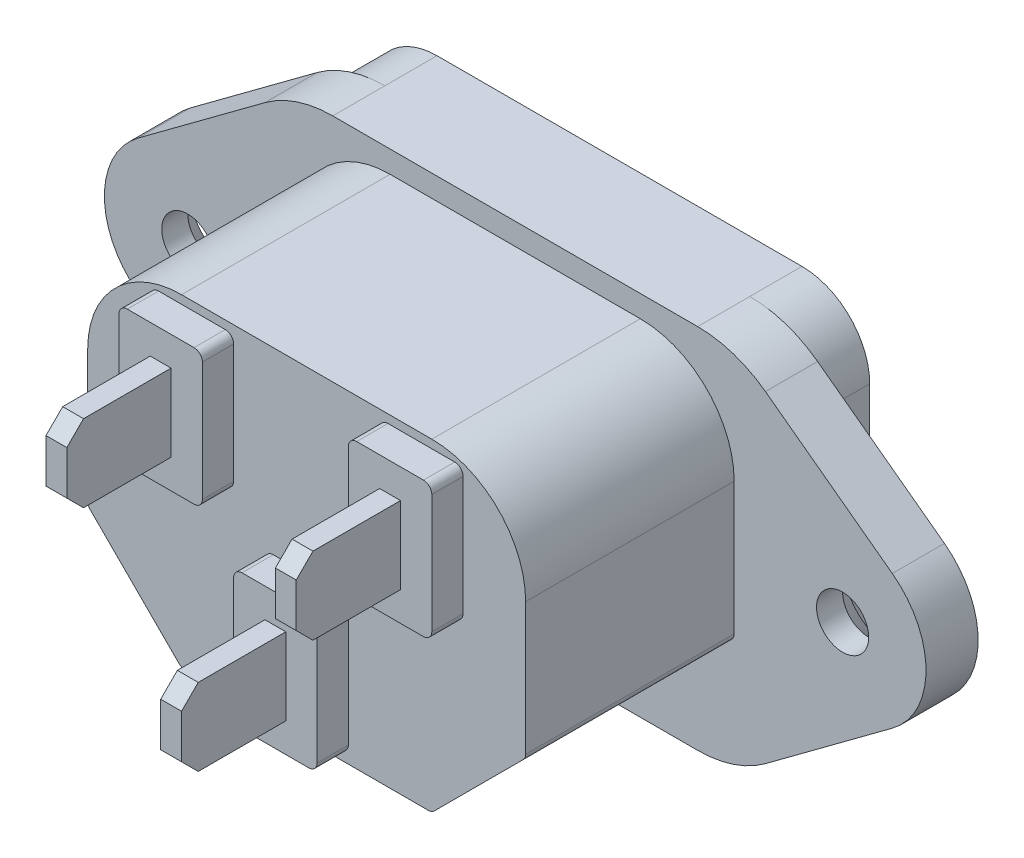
from build123d import *

# Parameters (mm, degrees)
BASE_EXTRUDE_DEPTH  = 3.175
SKETCH2_R           = 1.5875
CUT_EXTRUDE1_DEPTH  = 28.585031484
CHAMFER1_SIZE       = 1.5875
BOSS_EXTRUDE1_DEPTH = 3.175
BOSS_EXTRUDE2_DEPTH = 12.7
SKETCH8_W           = 5.08
SKETCH8_H           = 8.255
BOSS_EXTRUDE3_DEPTH = 1.905
FILLET2_R           = 0.508
CUT_EXTRUDE3_DEPTH  = 16.51
FILLET4_R           = 0.508
SKETCH10_W          = 1.27
SKETCH10_H          = 4.699
BOSS_EXTRUDE4_DEPTH = 6.35
CHAMFER2_SIZE       = 1.016
SKETCH11_W          = 1.905
SKETCH11_H          = 4.064
BOSS_EXTRUDE5_DEPTH = 14.605
SKETCH12_W          = 1.905
SKETCH12_H          = 4.064
BOSS_EXTRUDE6_DEPTH = 17.78
CHAMFER11_SIZE      = 0.8128


with BuildPart() as part:
    # Sketch1 → Base-Extrude (new body)
    with BuildSketch(Plane.XY):
        with BuildLine():
            Line((11.1125, 11.176), (-11.1125, 11.176))
            ThreePointArc((-11.1125, 11.176), (-13.286018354, 10.826168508), (-15.24, 9.812008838))
            Line((-15.24, 9.812008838), (-22.965953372, 4.079700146))
            ThreePointArc((-22.965953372, 4.079700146), (-25.019, 0), (-22.965953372, -4.079700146))
            Line((-22.965953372, -4.079700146), (-15.24, -9.812008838))
            ThreePointArc((-15.24, -9.812008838), (-13.286018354, -10.826168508), (-11.1125, -11.176))
            Line((-11.1125, -11.176), (11.1125, -11.176))
            ThreePointArc((11.1125, -11.176), (13.286018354, -10.826168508), (15.24, -9.812008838))
            Line((15.24, -9.812008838), (22.965953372, -4.079700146))
            ThreePointArc((22.965953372, -4.079700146), (25.019, 0), (22.965953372, 4.079700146))
            Line((22.965953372, 4.079700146), (15.24, 9.812008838))
            ThreePointArc((15.24, 9.812008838), (13.286018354, 10.826168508), (11.1125, 11.176))
        make_face()
    extrude(amount=BASE_EXTRUDE_DEPTH)

    # Sketch2 → Cut-Extrude1 (cut, through all)
    with BuildSketch(Plane(origin=(0, 0, 0), x_dir=(-1, 0, 0), z_dir=(0, 0, -1))):
        with Locations((19.939, 0)):
            Circle(SKETCH2_R)
        with Locations((-19.939, 0)):
            Circle(SKETCH2_R)
    extrude(amount=-CUT_EXTRUDE1_DEPTH, mode=Mode.SUBTRACT)

    # Chamfer1
    chamfer1_edges = [part.edges().sort_by_distance(p)[0] for p in [
        (-18.3515, 0, 0),
        (21.5265, 0, 0),
    ]]
    chamfer(chamfer1_edges, length=CHAMFER1_SIZE)

    # Sketch3 → Boss-Extrude1 (add)
    with BuildSketch(Plane(origin=(0, 0, 0), x_dir=(-1, 0, 0), z_dir=(0, 0, -1))):
        with BuildLine():
            Line((-11.1125, 11.176), (11.1125, 11.176))
            ThreePointArc((11.1125, 11.176), (14.031083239, 9.967083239), (15.24, 7.0485))
            Line((15.24, 7.0485), (15.24, -7.0485))
            ThreePointArc((15.24, -7.0485), (14.031083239, -9.967083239), (11.1125, -11.176))
            Line((11.1125, -11.176), (-11.1125, -11.176))
            ThreePointArc((-11.1125, -11.176), (-14.031083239, -9.967083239), (-15.24, -7.0485))
            Line((-15.24, -7.0485), (-15.24, 7.0485))
            ThreePointArc((-15.24, 7.0485), (-14.031083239, 9.967083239), (-11.1125, 11.176))
        make_face()
    extrude(amount=BOSS_EXTRUDE1_DEPTH)

    # Sketch7 → Boss-Extrude2 (add)
    with BuildSketch(Plane.XY.offset(3.175)):
        with BuildLine():
            Line((-7.62, 9.8425), (7.62, 9.8425))
            ThreePointArc((7.62, 9.8425), (11.661115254, 8.168615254), (13.335, 4.1275))
            Line((13.335, 4.1275), (13.335, -4.1275))
            Line((13.335, -4.1275), (7.62, -9.8425))
            Line((7.62, -9.8425), (-7.62, -9.8425))
            Line((-7.62, -9.8425), (-13.335, -4.1275))
            Line((-13.335, -4.1275), (-13.335, 4.1275))
            ThreePointArc((-13.335, 4.1275), (-11.661115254, 8.168615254), (-7.62, 9.8425))
        make_face()
    extrude(amount=BOSS_EXTRUDE2_DEPTH)

    # Sketch8 → Boss-Extrude3 (add)
    with BuildSketch(Plane.XY.offset(15.875)):
        with Locations((-6.985, 5.207)):
            Rectangle(SKETCH8_W, SKETCH8_H)
        with Locations((6.985, 5.207)):
            Rectangle(SKETCH8_W, SKETCH8_H)
        with Locations((0, -5.207)):
            Rectangle(SKETCH8_W, SKETCH8_H)
    extrude(amount=BOSS_EXTRUDE3_DEPTH)

    # Fillet2
    fillet2_edges = [part.edges().sort_by_distance(p)[0] for p in [
        (-4.445, 1.0795, 16.8275),
        (-4.445, 9.3345, 16.8275),
        (4.445, 9.3345, 16.8275),
        (4.445, 1.0795, 16.8275),
        (9.525, 1.0795, 16.8275),
        (9.525, 9.3345, 16.8275),
        (-2.54, -1.0795, 16.8275),
        (-2.54, -9.3345, 16.8275),
        (2.54, -9.3345, 16.8275),
        (2.54, -1.0795, 16.8275),
        (-9.525, 9.3345, 16.8275),
        (-9.525, 1.0795, 16.8275),
    ]]
    fillet(fillet2_edges, radius=FILLET2_R)

    # Sketch5 → Cut-Extrude3 (cut)
    with BuildSketch(Plane(origin=(0, 0, -3.175), x_dir=(-1, 0, 0), z_dir=(0, 0, -1))):
        with BuildLine():
            Line((-8.509, 8.128), (8.509, 8.128))
            ThreePointArc((8.509, 8.128), (11.113274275, 7.049274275), (12.192, 4.445))
            Line((12.192, 4.445), (12.192, -4.445))
            Line((12.192, -4.445), (8.509, -8.128))
            Line((8.509, -8.128), (-8.509, -8.128))
            Line((-8.509, -8.128), (-12.192, -4.445))
            Line((-12.192, -4.445), (-12.192, 4.445))
            ThreePointArc((-12.192, 4.445), (-11.113274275, 7.049274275), (-8.509, 8.128))
        make_face()
    extrude(amount=-CUT_EXTRUDE3_DEPTH, mode=Mode.SUBTRACT)

    # Fillet4
    fillet4_edges = [part.edges().sort_by_distance(p)[0] for p in [
        (-12.192, -4.445, 5.08),
        (-8.509, -8.128, 5.08),
        (8.509, -8.128, 5.08),
        (12.192, -4.445, 5.08),
        (-13.335, -4.1275, 9.525),
        (-7.62, -9.8425, 9.525),
        (7.62, -9.8425, 9.525),
        (13.335, -4.1275, 9.525),
    ]]
    fillet(fillet4_edges, radius=FILLET4_R)

    # Sketch10 → Boss-Extrude4 (add)
    with BuildSketch(Plane.XY.offset(17.78)):
        with Locations((6.985, 5.207)):
            Rectangle(SKETCH10_W, SKETCH10_H)
        with Locations((-6.985, 5.207)):
            Rectangle(SKETCH10_W, SKETCH10_H)
        with Locations((0, -5.207)):
            Rectangle(SKETCH10_W, SKETCH10_H)
    extrude(amount=BOSS_EXTRUDE4_DEPTH)

    # Chamfer2
    chamfer2_edges = [part.edges().sort_by_distance(p)[0] for p in [
        (6.985, 2.8575, 24.13),
        (6.985, 7.5565, 24.13),
        (-6.985, 2.8575, 24.13),
        (-6.985, 7.5565, 24.13),
        (0, -7.5565, 24.13),
        (0, -2.8575, 24.13),
    ]]
    chamfer(chamfer2_edges, length=CHAMFER2_SIZE)

    # Sketch11 → Boss-Extrude5 (add)
    with BuildSketch(Plane(origin=(0, 0, 13.335), x_dir=(-1, 0, 0), z_dir=(0, 0, -1))):
        with Locations((7.0485, 2.286)):
            Rectangle(SKETCH11_W, SKETCH11_H)
        with Locations((-7.0485, 2.286)):
            Rectangle(SKETCH11_W, SKETCH11_H)
    extrude(amount=BOSS_EXTRUDE5_DEPTH)

    # Sketch12 → Boss-Extrude6 (add)
    with BuildSketch(Plane(origin=(0, 0, 13.335), x_dir=(-1, 0, 0), z_dir=(0, 0, -1))):
        with Locations((-0.1905, -1.905)):
            Rectangle(SKETCH12_W, SKETCH12_H)
    extrude(amount=BOSS_EXTRUDE6_DEPTH)

    # Chamfer11
    chamfer11_edges = [part.edges().sort_by_distance(p)[0] for p in [
        (-8.001, 2.286, -1.27),
        (-6.096, 2.286, -1.27),
        (-7.0485, 4.318, -1.27),
        (-7.0485, 0.254, -1.27),
        (6.096, 2.286, -1.27),
        (8.001, 2.286, -1.27),
        (7.0485, 4.318, -1.27),
        (7.0485, 0.254, -1.27),
        (-0.762, -1.905, -4.445),
        (1.143, -1.905, -4.445),
        (0.1905, 0.127, -4.445),
        (0.1905, -3.937, -4.445),
    ]]
    chamfer(chamfer11_edges, length=CHAMFER11_SIZE)


solid = part.part
